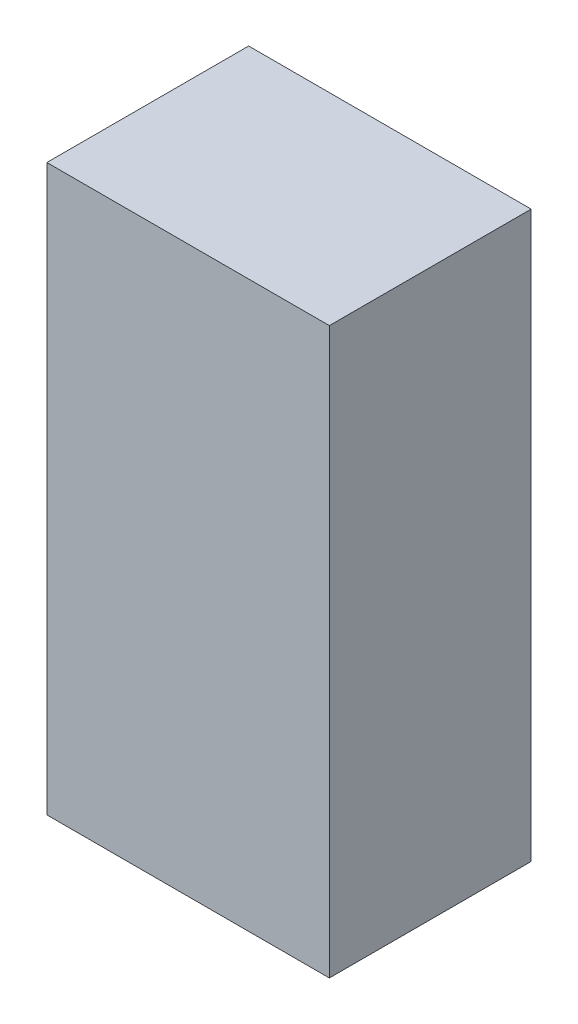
from build123d import *

# Parameters (mm, degrees)
SKETCH1_W           = 17.78
SKETCH1_H           = 35.56
BOSS_EXTRUDE2_DEPTH = 12.7


with BuildPart() as part:
    # Sketch1 → Boss-Extrude2 (new body)
    with BuildSketch(Plane.XY):
        Rectangle(SKETCH1_W, SKETCH1_H)
    extrude(amount=BOSS_EXTRUDE2_DEPTH)


solid = part.part
